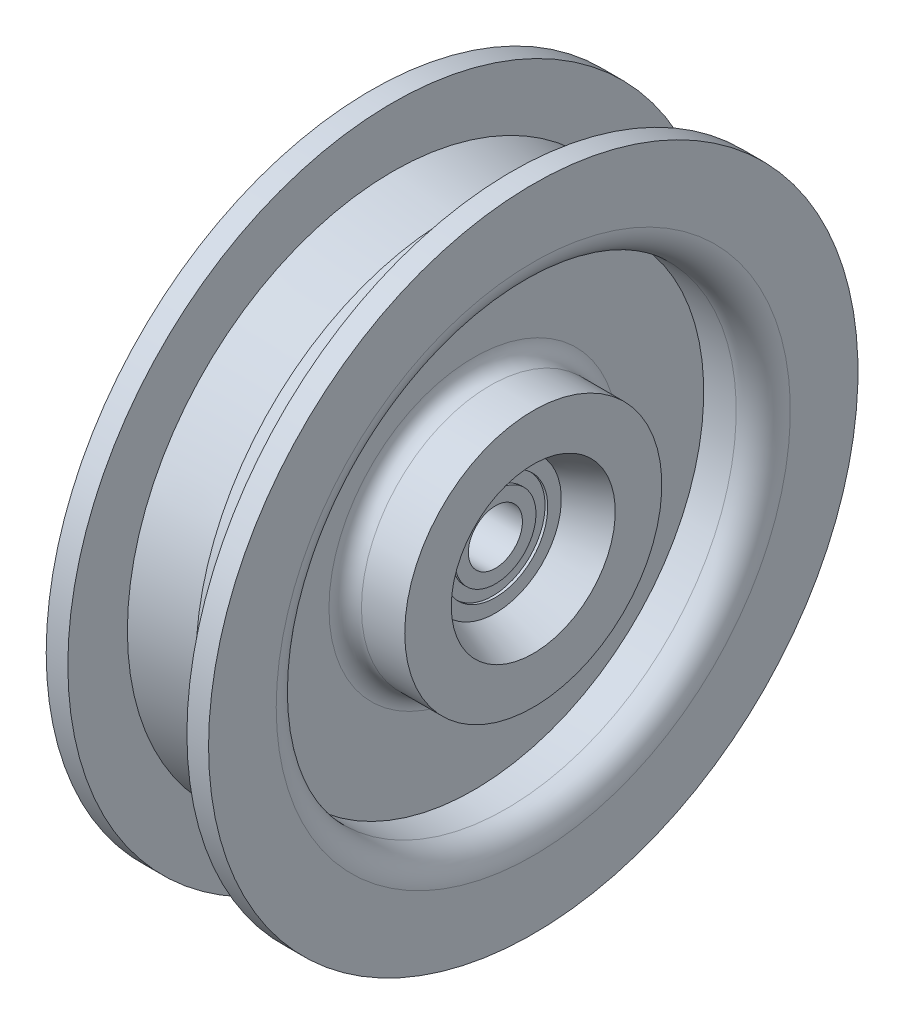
from build123d import *


with BuildPart() as part:
    # Esquisse1 → R_volution1 (revolve)
    with BuildSketch(Plane.XY, mode=Mode.PRIVATE) as r_volution1_sk:
        with BuildLine():
            Line((-15, 60), (-15, 47.5))
            ThreePointArc((-15, 47.5), (-13.535533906, 43.964466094), (-10, 42.5))
            Line((-10, 42.5), (-4, 42.5))
            Line((-4, 42.5), (-4, 26.75))
            ThreePointArc((-4, 26.75), (-4.878679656, 24.628679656), (-7, 23.75))
            Line((-7, 23.75), (-15, 23.75))
            Line((-15, 23.75), (-15, 15.15))
            Line((-15, 15.15), (-8, 12.18))
            Line((-8, 12.18), (8, 12.18))
            Line((8, 12.18), (15, 15.15))
            Line((15, 15.15), (15, 23.75))
            Line((15, 23.75), (7, 23.75))
            ThreePointArc((7, 23.75), (4.878679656, 24.628679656), (4, 26.75))
            Line((4, 26.75), (4, 42.5))
            Line((4, 42.5), (10, 42.5))
            ThreePointArc((10, 42.5), (13.535533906, 43.964466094), (15, 47.5))
            Line((15, 47.5), (15, 60))
            Line((15, 60), (11, 60))
            Line((11, 60), (11, 49))
            Line((11, 49), (0, 47.33))
            Line((0, 47.33), (-11, 49))
            Line((-11, 49), (-11, 60))
            Line((-11, 60), (-15, 60))
        make_face()
    revolve(r_volution1_sk.sketch.rotate(Axis((0, 0, 0), (1, 0, 0)), 90), axis=Axis((0, 0, 0), (1, 0, 0)))

    # Esquisse2 → R_volution2 (revolve)
    with BuildSketch(Plane.XY, mode=Mode.PRIVATE) as r_volution2_sk:
        Polygon((0, 12.18), (8, 12.18), (8, 9.68), (7.5, 9.68), (7.5, 7.5), (8, 7.5), (8, 5), (0, 5), (0, 7.5), (0.5, 7.5), (0.5, 9.68), (0, 9.68), align=None)
    r_volution2 = revolve(r_volution2_sk.sketch.rotate(Axis((0, 0, 0), (1, 0, 0)), 90), axis=Axis((0, 0, 0), (1, 0, 0)))

    # Sym_trie1: R_volution2 across Right Plane
    add(r_volution2.mirror(Plane(origin=(0, 0, 0), x_dir=(0, 0, -1), z_dir=(1, 0, 0))))


solid = part.part
